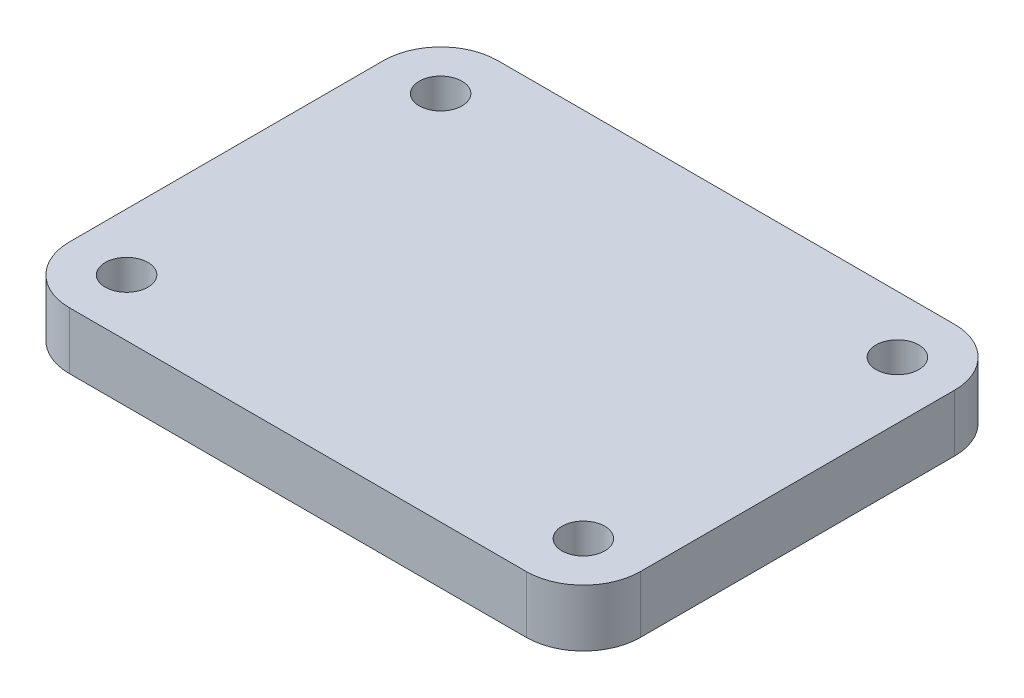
ISO-10303-21;
HEADER;
FILE_DESCRIPTION(('STEP AP214'),'2;1');
FILE_NAME('part.step','',(''),(''),'','','');
FILE_SCHEMA(('AUTOMOTIVE_DESIGN { 1 0 10303 214 1 1 1 1 }'));
ENDSEC;
DATA;
#1=APPLICATION_CONTEXT('core data for automotive mechanical design processes');
#2=APPLICATION_PROTOCOL_DEFINITION('international standard','automotive_design',2000,#1);
#3=PRODUCT_CONTEXT('',#1,'mechanical');
#4=PRODUCT('Part','Part','',(#3));
#5=PRODUCT_RELATED_PRODUCT_CATEGORY('part','',(#4));
#6=PRODUCT_DEFINITION_FORMATION('','',#4);
#7=PRODUCT_DEFINITION_CONTEXT('part definition',#1,'design');
#8=PRODUCT_DEFINITION('design','',#6,#7);
#9=PRODUCT_DEFINITION_SHAPE('','',#8);
#10=(LENGTH_UNIT() NAMED_UNIT(*) SI_UNIT(.MILLI.,.METRE.));
#11=(NAMED_UNIT(*) PLANE_ANGLE_UNIT() SI_UNIT($,.RADIAN.));
#12=(NAMED_UNIT(*) SI_UNIT($,.STERADIAN.) SOLID_ANGLE_UNIT());
#13=UNCERTAINTY_MEASURE_WITH_UNIT(LENGTH_MEASURE(1.E-05),#10,'distance_accuracy_value','');
#14=(GEOMETRIC_REPRESENTATION_CONTEXT(3) GLOBAL_UNCERTAINTY_ASSIGNED_CONTEXT((#13)) GLOBAL_UNIT_ASSIGNED_CONTEXT((#10,
#11,#12)) REPRESENTATION_CONTEXT('',''));
#15=CARTESIAN_POINT('',(0.,0.,0.));
#16=DIRECTION('',(0.,0.,1.));
#17=DIRECTION('',(1.,0.,0.));
#18=AXIS2_PLACEMENT_3D('',#15,#16,#17);
#19=CARTESIAN_POINT('',(-100.,20.,-75.));
#20=DIRECTION('',(0.,-1.,0.));
#21=DIRECTION('',(0.,0.,-1.));
#22=AXIS2_PLACEMENT_3D('',#19,#20,#21);
#23=PLANE('',#22);
#24=CARTESIAN_POINT('',(80.,20.,55.));
#25=DIRECTION('',(0.,1.,0.));
#26=DIRECTION('',(0.,0.,1.));
#27=AXIS2_PLACEMENT_3D('',#24,#25,#26);
#28=CIRCLE('',#27,7.50000000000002);
#29=CARTESIAN_POINT('',(80.,20.,62.5));
#30=VERTEX_POINT('',#29);
#31=EDGE_CURVE('E190',#30,#30,#28,.T.);
#32=ORIENTED_EDGE('',*,*,#31,.F.);
#33=EDGE_LOOP('',(#32));
#34=FACE_BOUND('',#33,.T.);
#35=CARTESIAN_POINT('',(-80.,20.,-55.));
#36=DIRECTION('',(0.,1.,0.));
#37=DIRECTION('',(0.,0.,1.));
#38=AXIS2_PLACEMENT_3D('',#35,#36,#37);
#39=CIRCLE('',#38,7.50000000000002);
#40=CARTESIAN_POINT('',(-80.,20.,-47.5));
#41=VERTEX_POINT('',#40);
#42=EDGE_CURVE('E184',#41,#41,#39,.T.);
#43=ORIENTED_EDGE('',*,*,#42,.F.);
#44=EDGE_LOOP('',(#43));
#45=FACE_BOUND('',#44,.T.);
#46=CARTESIAN_POINT('',(-80.,20.,55.));
#47=DIRECTION('',(0.,1.,0.));
#48=DIRECTION('',(0.,0.,1.));
#49=AXIS2_PLACEMENT_3D('',#46,#47,#48);
#50=CIRCLE('',#49,7.50000000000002);
#51=CARTESIAN_POINT('',(-80.,20.,62.5));
#52=VERTEX_POINT('',#51);
#53=EDGE_CURVE('E132',#52,#52,#50,.T.);
#54=ORIENTED_EDGE('',*,*,#53,.F.);
#55=EDGE_LOOP('',(#54));
#56=FACE_BOUND('',#55,.T.);
#57=DIRECTION('',(-1.,0.,0.));
#58=VECTOR('',#57,1.);
#59=CARTESIAN_POINT('',(-100.,20.,-75.));
#60=LINE('',#59,#58);
#61=CARTESIAN_POINT('',(80.,20.,-75.));
#62=VERTEX_POINT('',#61);
#63=CARTESIAN_POINT('',(-80.,20.,-75.));
#64=VERTEX_POINT('',#63);
#65=EDGE_CURVE('E135',#62,#64,#60,.T.);
#66=ORIENTED_EDGE('',*,*,#65,.T.);
#67=CARTESIAN_POINT('',(-80.,20.,-55.));
#68=DIRECTION('',(0.,-1.,0.));
#69=DIRECTION('',(0.,0.,-1.));
#70=AXIS2_PLACEMENT_3D('',#67,#68,#69);
#71=CIRCLE('',#70,20.);
#72=CARTESIAN_POINT('',(-100.,20.,-55.));
#73=VERTEX_POINT('',#72);
#74=EDGE_CURVE('E154',#64,#73,#71,.F.);
#75=ORIENTED_EDGE('',*,*,#74,.T.);
#76=DIRECTION('',(0.,0.,1.));
#77=VECTOR('',#76,1.);
#78=CARTESIAN_POINT('',(-100.,20.,75.));
#79=LINE('',#78,#77);
#80=CARTESIAN_POINT('',(-100.,20.,55.));
#81=VERTEX_POINT('',#80);
#82=EDGE_CURVE('E118',#73,#81,#79,.T.);
#83=ORIENTED_EDGE('',*,*,#82,.T.);
#84=CARTESIAN_POINT('',(-80.,20.,55.));
#85=DIRECTION('',(0.,-1.,0.));
#86=DIRECTION('',(0.,0.,-1.));
#87=AXIS2_PLACEMENT_3D('',#84,#85,#86);
#88=CIRCLE('',#87,20.);
#89=CARTESIAN_POINT('',(-80.,20.,75.));
#90=VERTEX_POINT('',#89);
#91=EDGE_CURVE('E149',#81,#90,#88,.F.);
#92=ORIENTED_EDGE('',*,*,#91,.T.);
#93=DIRECTION('',(1.,0.,0.));
#94=VECTOR('',#93,1.);
#95=CARTESIAN_POINT('',(-100.,20.,75.));
#96=LINE('',#95,#94);
#97=CARTESIAN_POINT('',(80.,20.,75.));
#98=VERTEX_POINT('',#97);
#99=EDGE_CURVE('E165',#90,#98,#96,.T.);
#100=ORIENTED_EDGE('',*,*,#99,.T.);
#101=CARTESIAN_POINT('',(80.,20.,55.));
#102=DIRECTION('',(0.,-1.,0.));
#103=DIRECTION('',(0.,0.,-1.));
#104=AXIS2_PLACEMENT_3D('',#101,#102,#103);
#105=CIRCLE('',#104,20.);
#106=CARTESIAN_POINT('',(100.,20.,55.));
#107=VERTEX_POINT('',#106);
#108=EDGE_CURVE('E54',#98,#107,#105,.F.);
#109=ORIENTED_EDGE('',*,*,#108,.T.);
#110=DIRECTION('',(0.,0.,-1.));
#111=VECTOR('',#110,1.);
#112=CARTESIAN_POINT('',(100.,20.,75.));
#113=LINE('',#112,#111);
#114=CARTESIAN_POINT('',(100.,20.,-55.));
#115=VERTEX_POINT('',#114);
#116=EDGE_CURVE('E173',#107,#115,#113,.T.);
#117=ORIENTED_EDGE('',*,*,#116,.T.);
#118=CARTESIAN_POINT('',(80.,20.,-55.));
#119=DIRECTION('',(0.,-1.,0.));
#120=DIRECTION('',(0.,0.,-1.));
#121=AXIS2_PLACEMENT_3D('',#118,#119,#120);
#122=CIRCLE('',#121,20.);
#123=EDGE_CURVE('E152',#115,#62,#122,.F.);
#124=ORIENTED_EDGE('',*,*,#123,.T.);
#125=EDGE_LOOP('',(#66,#75,#83,#92,#100,#109,#117,#124));
#126=FACE_BOUND('',#125,.T.);
#127=CARTESIAN_POINT('',(80.,20.,-55.));
#128=DIRECTION('',(0.,1.,0.));
#129=DIRECTION('',(0.,0.,1.));
#130=AXIS2_PLACEMENT_3D('',#127,#128,#129);
#131=CIRCLE('',#130,7.50000000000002);
#132=CARTESIAN_POINT('',(80.,20.,-47.5));
#133=VERTEX_POINT('',#132);
#134=EDGE_CURVE('E196',#133,#133,#131,.T.);
#135=ORIENTED_EDGE('',*,*,#134,.F.);
#136=EDGE_LOOP('',(#135));
#137=FACE_BOUND('',#136,.T.);
#138=ADVANCED_FACE('F32',(#34,#45,#56,#126,#137),#23,.F.);
#139=CARTESIAN_POINT('',(-100.,0.,-75.));
#140=DIRECTION('',(0.,-1.,0.));
#141=DIRECTION('',(0.,0.,-1.));
#142=AXIS2_PLACEMENT_3D('',#139,#140,#141);
#143=PLANE('',#142);
#144=CARTESIAN_POINT('',(80.,0.,-55.));
#145=DIRECTION('',(0.,1.,0.));
#146=DIRECTION('',(0.,0.,1.));
#147=AXIS2_PLACEMENT_3D('',#144,#145,#146);
#148=CIRCLE('',#147,7.50000000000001);
#149=CARTESIAN_POINT('',(80.,0.,-47.5));
#150=VERTEX_POINT('',#149);
#151=EDGE_CURVE('E193',#150,#150,#148,.T.);
#152=ORIENTED_EDGE('',*,*,#151,.T.);
#153=EDGE_LOOP('',(#152));
#154=FACE_BOUND('',#153,.T.);
#155=CARTESIAN_POINT('',(-80.,0.,-55.));
#156=DIRECTION('',(0.,1.,0.));
#157=DIRECTION('',(0.,0.,1.));
#158=AXIS2_PLACEMENT_3D('',#155,#156,#157);
#159=CIRCLE('',#158,7.50000000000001);
#160=CARTESIAN_POINT('',(-80.,0.,-47.5));
#161=VERTEX_POINT('',#160);
#162=EDGE_CURVE('E181',#161,#161,#159,.T.);
#163=ORIENTED_EDGE('',*,*,#162,.T.);
#164=EDGE_LOOP('',(#163));
#165=FACE_BOUND('',#164,.T.);
#166=CARTESIAN_POINT('',(-80.,0.,55.));
#167=DIRECTION('',(0.,1.,0.));
#168=DIRECTION('',(0.,0.,1.));
#169=AXIS2_PLACEMENT_3D('',#166,#167,#168);
#170=CIRCLE('',#169,7.50000000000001);
#171=CARTESIAN_POINT('',(-80.,0.,62.5));
#172=VERTEX_POINT('',#171);
#173=EDGE_CURVE('E126',#172,#172,#170,.T.);
#174=ORIENTED_EDGE('',*,*,#173,.T.);
#175=EDGE_LOOP('',(#174));
#176=FACE_BOUND('',#175,.T.);
#177=DIRECTION('',(0.,0.,1.));
#178=VECTOR('',#177,1.);
#179=CARTESIAN_POINT('',(-100.,0.,75.));
#180=LINE('',#179,#178);
#181=CARTESIAN_POINT('',(-100.,0.,-55.));
#182=VERTEX_POINT('',#181);
#183=CARTESIAN_POINT('',(-100.,0.,55.));
#184=VERTEX_POINT('',#183);
#185=EDGE_CURVE('E115',#182,#184,#180,.T.);
#186=ORIENTED_EDGE('',*,*,#185,.F.);
#187=CARTESIAN_POINT('',(-80.,0.,-55.));
#188=DIRECTION('',(0.,-1.,0.));
#189=DIRECTION('',(0.,0.,-1.));
#190=AXIS2_PLACEMENT_3D('',#187,#188,#189);
#191=CIRCLE('',#190,20.);
#192=CARTESIAN_POINT('',(-80.,0.,-75.));
#193=VERTEX_POINT('',#192);
#194=EDGE_CURVE('E98',#182,#193,#191,.T.);
#195=ORIENTED_EDGE('',*,*,#194,.T.);
#196=DIRECTION('',(-1.,0.,0.));
#197=VECTOR('',#196,1.);
#198=CARTESIAN_POINT('',(-100.,0.,-75.));
#199=LINE('',#198,#197);
#200=CARTESIAN_POINT('',(80.,0.,-75.));
#201=VERTEX_POINT('',#200);
#202=EDGE_CURVE('E139',#201,#193,#199,.T.);
#203=ORIENTED_EDGE('',*,*,#202,.F.);
#204=CARTESIAN_POINT('',(80.,0.,-55.));
#205=DIRECTION('',(0.,-1.,0.));
#206=DIRECTION('',(0.,0.,-1.));
#207=AXIS2_PLACEMENT_3D('',#204,#205,#206);
#208=CIRCLE('',#207,20.);
#209=CARTESIAN_POINT('',(100.,0.,-55.));
#210=VERTEX_POINT('',#209);
#211=EDGE_CURVE('E109',#201,#210,#208,.T.);
#212=ORIENTED_EDGE('',*,*,#211,.T.);
#213=DIRECTION('',(0.,0.,-1.));
#214=VECTOR('',#213,1.);
#215=CARTESIAN_POINT('',(100.,0.,75.));
#216=LINE('',#215,#214);
#217=CARTESIAN_POINT('',(100.,0.,55.));
#218=VERTEX_POINT('',#217);
#219=EDGE_CURVE('E129',#218,#210,#216,.T.);
#220=ORIENTED_EDGE('',*,*,#219,.F.);
#221=CARTESIAN_POINT('',(80.,0.,55.));
#222=DIRECTION('',(0.,-1.,0.));
#223=DIRECTION('',(0.,0.,-1.));
#224=AXIS2_PLACEMENT_3D('',#221,#222,#223);
#225=CIRCLE('',#224,20.);
#226=CARTESIAN_POINT('',(80.,0.,75.));
#227=VERTEX_POINT('',#226);
#228=EDGE_CURVE('E143',#218,#227,#225,.T.);
#229=ORIENTED_EDGE('',*,*,#228,.T.);
#230=DIRECTION('',(1.,0.,0.));
#231=VECTOR('',#230,1.);
#232=CARTESIAN_POINT('',(-100.,0.,75.));
#233=LINE('',#232,#231);
#234=CARTESIAN_POINT('',(-80.,0.,75.));
#235=VERTEX_POINT('',#234);
#236=EDGE_CURVE('E125',#235,#227,#233,.T.);
#237=ORIENTED_EDGE('',*,*,#236,.F.);
#238=CARTESIAN_POINT('',(-80.,0.,55.));
#239=DIRECTION('',(0.,-1.,0.));
#240=DIRECTION('',(0.,0.,-1.));
#241=AXIS2_PLACEMENT_3D('',#238,#239,#240);
#242=CIRCLE('',#241,20.);
#243=EDGE_CURVE('E119',#235,#184,#242,.T.);
#244=ORIENTED_EDGE('',*,*,#243,.T.);
#245=EDGE_LOOP('',(#186,#195,#203,#212,#220,#229,#237,#244));
#246=FACE_BOUND('',#245,.T.);
#247=CARTESIAN_POINT('',(80.,0.,55.));
#248=DIRECTION('',(0.,1.,0.));
#249=DIRECTION('',(0.,0.,1.));
#250=AXIS2_PLACEMENT_3D('',#247,#248,#249);
#251=CIRCLE('',#250,7.50000000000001);
#252=CARTESIAN_POINT('',(80.,0.,62.5));
#253=VERTEX_POINT('',#252);
#254=EDGE_CURVE('E187',#253,#253,#251,.T.);
#255=ORIENTED_EDGE('',*,*,#254,.T.);
#256=EDGE_LOOP('',(#255));
#257=FACE_BOUND('',#256,.T.);
#258=ADVANCED_FACE('F122',(#154,#165,#176,#246,#257),#143,.T.);
#259=CARTESIAN_POINT('',(-100.,20.,75.));
#260=DIRECTION('',(1.,0.,0.));
#261=DIRECTION('',(0.,0.,-1.));
#262=AXIS2_PLACEMENT_3D('',#259,#260,#261);
#263=PLANE('',#262);
#264=ORIENTED_EDGE('',*,*,#82,.F.);
#265=DIRECTION('',(0.,-1.,0.));
#266=VECTOR('',#265,1.);
#267=CARTESIAN_POINT('',(-100.,20.,-55.));
#268=LINE('',#267,#266);
#269=EDGE_CURVE('E102',#73,#182,#268,.T.);
#270=ORIENTED_EDGE('',*,*,#269,.T.);
#271=ORIENTED_EDGE('',*,*,#185,.T.);
#272=DIRECTION('',(0.,-1.,0.));
#273=VECTOR('',#272,1.);
#274=CARTESIAN_POINT('',(-100.,20.,55.));
#275=LINE('',#274,#273);
#276=EDGE_CURVE('E120',#184,#81,#275,.F.);
#277=ORIENTED_EDGE('',*,*,#276,.T.);
#278=EDGE_LOOP('',(#264,#270,#271,#277));
#279=FACE_BOUND('',#278,.T.);
#280=ADVANCED_FACE('F114',(#279),#263,.F.);
#281=CARTESIAN_POINT('',(-100.,20.,75.));
#282=DIRECTION('',(0.,0.,-1.));
#283=DIRECTION('',(-1.,0.,0.));
#284=AXIS2_PLACEMENT_3D('',#281,#282,#283);
#285=PLANE('',#284);
#286=ORIENTED_EDGE('',*,*,#236,.T.);
#287=DIRECTION('',(0.,-1.,0.));
#288=VECTOR('',#287,1.);
#289=CARTESIAN_POINT('',(80.,20.,75.));
#290=LINE('',#289,#288);
#291=EDGE_CURVE('E11',#227,#98,#290,.F.);
#292=ORIENTED_EDGE('',*,*,#291,.T.);
#293=ORIENTED_EDGE('',*,*,#99,.F.);
#294=DIRECTION('',(0.,-1.,0.));
#295=VECTOR('',#294,1.);
#296=CARTESIAN_POINT('',(-80.,20.,75.));
#297=LINE('',#296,#295);
#298=EDGE_CURVE('E40',#90,#235,#297,.T.);
#299=ORIENTED_EDGE('',*,*,#298,.T.);
#300=EDGE_LOOP('',(#286,#292,#293,#299));
#301=FACE_BOUND('',#300,.T.);
#302=ADVANCED_FACE('F163',(#301),#285,.F.);
#303=CARTESIAN_POINT('',(100.,20.,75.));
#304=DIRECTION('',(-1.,0.,0.));
#305=DIRECTION('',(0.,0.,1.));
#306=AXIS2_PLACEMENT_3D('',#303,#304,#305);
#307=PLANE('',#306);
#308=ORIENTED_EDGE('',*,*,#219,.T.);
#309=DIRECTION('',(0.,-1.,0.));
#310=VECTOR('',#309,1.);
#311=CARTESIAN_POINT('',(100.,20.,-55.));
#312=LINE('',#311,#310);
#313=EDGE_CURVE('E47',#210,#115,#312,.F.);
#314=ORIENTED_EDGE('',*,*,#313,.T.);
#315=ORIENTED_EDGE('',*,*,#116,.F.);
#316=DIRECTION('',(0.,-1.,0.));
#317=VECTOR('',#316,1.);
#318=CARTESIAN_POINT('',(100.,20.,55.));
#319=LINE('',#318,#317);
#320=EDGE_CURVE('E156',#107,#218,#319,.T.);
#321=ORIENTED_EDGE('',*,*,#320,.T.);
#322=EDGE_LOOP('',(#308,#314,#315,#321));
#323=FACE_BOUND('',#322,.T.);
#324=ADVANCED_FACE('F172',(#323),#307,.F.);
#325=CARTESIAN_POINT('',(-100.,20.,-75.));
#326=DIRECTION('',(0.,0.,1.));
#327=DIRECTION('',(1.,0.,0.));
#328=AXIS2_PLACEMENT_3D('',#325,#326,#327);
#329=PLANE('',#328);
#330=ORIENTED_EDGE('',*,*,#202,.T.);
#331=DIRECTION('',(0.,-1.,0.));
#332=VECTOR('',#331,1.);
#333=CARTESIAN_POINT('',(-80.,20.,-75.));
#334=LINE('',#333,#332);
#335=EDGE_CURVE('E103',#193,#64,#334,.F.);
#336=ORIENTED_EDGE('',*,*,#335,.T.);
#337=ORIENTED_EDGE('',*,*,#65,.F.);
#338=DIRECTION('',(0.,-1.,0.));
#339=VECTOR('',#338,1.);
#340=CARTESIAN_POINT('',(80.,20.,-75.));
#341=LINE('',#340,#339);
#342=EDGE_CURVE('E108',#62,#201,#341,.T.);
#343=ORIENTED_EDGE('',*,*,#342,.T.);
#344=EDGE_LOOP('',(#330,#336,#337,#343));
#345=FACE_BOUND('',#344,.T.);
#346=ADVANCED_FACE('F216',(#345),#329,.F.);
#347=CARTESIAN_POINT('',(-80.,20.,-55.));
#348=DIRECTION('',(0.,-1.,0.));
#349=DIRECTION('',(0.,0.,-1.));
#350=AXIS2_PLACEMENT_3D('',#347,#348,#349);
#351=CYLINDRICAL_SURFACE('',#350,20.);
#352=ORIENTED_EDGE('',*,*,#74,.F.);
#353=ORIENTED_EDGE('',*,*,#335,.F.);
#354=ORIENTED_EDGE('',*,*,#194,.F.);
#355=ORIENTED_EDGE('',*,*,#269,.F.);
#356=EDGE_LOOP('',(#352,#353,#354,#355));
#357=FACE_BOUND('',#356,.T.);
#358=ADVANCED_FACE('F101',(#357),#351,.T.);
#359=CARTESIAN_POINT('',(80.,20.,-55.));
#360=DIRECTION('',(0.,-1.,0.));
#361=DIRECTION('',(0.,0.,-1.));
#362=AXIS2_PLACEMENT_3D('',#359,#360,#361);
#363=CYLINDRICAL_SURFACE('',#362,20.);
#364=ORIENTED_EDGE('',*,*,#123,.F.);
#365=ORIENTED_EDGE('',*,*,#313,.F.);
#366=ORIENTED_EDGE('',*,*,#211,.F.);
#367=ORIENTED_EDGE('',*,*,#342,.F.);
#368=EDGE_LOOP('',(#364,#365,#366,#367));
#369=FACE_BOUND('',#368,.T.);
#370=ADVANCED_FACE('F228',(#369),#363,.T.);
#371=CARTESIAN_POINT('',(80.,20.,55.));
#372=DIRECTION('',(0.,-1.,0.));
#373=DIRECTION('',(0.,0.,-1.));
#374=AXIS2_PLACEMENT_3D('',#371,#372,#373);
#375=CYLINDRICAL_SURFACE('',#374,20.);
#376=ORIENTED_EDGE('',*,*,#108,.F.);
#377=ORIENTED_EDGE('',*,*,#291,.F.);
#378=ORIENTED_EDGE('',*,*,#228,.F.);
#379=ORIENTED_EDGE('',*,*,#320,.F.);
#380=EDGE_LOOP('',(#376,#377,#378,#379));
#381=FACE_BOUND('',#380,.T.);
#382=ADVANCED_FACE('F171',(#381),#375,.T.);
#383=CARTESIAN_POINT('',(-80.,20.,55.));
#384=DIRECTION('',(0.,-1.,0.));
#385=DIRECTION('',(0.,0.,-1.));
#386=AXIS2_PLACEMENT_3D('',#383,#384,#385);
#387=CYLINDRICAL_SURFACE('',#386,20.);
#388=ORIENTED_EDGE('',*,*,#91,.F.);
#389=ORIENTED_EDGE('',*,*,#276,.F.);
#390=ORIENTED_EDGE('',*,*,#243,.F.);
#391=ORIENTED_EDGE('',*,*,#298,.F.);
#392=EDGE_LOOP('',(#388,#389,#390,#391));
#393=FACE_BOUND('',#392,.T.);
#394=ADVANCED_FACE('F34',(#393),#387,.T.);
#395=CARTESIAN_POINT('',(-80.,20.,55.));
#396=DIRECTION('',(0.,1.,0.));
#397=DIRECTION('',(0.,0.,1.));
#398=AXIS2_PLACEMENT_3D('',#395,#396,#397);
#399=CYLINDRICAL_SURFACE('',#398,7.50000000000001);
#400=ORIENTED_EDGE('',*,*,#173,.F.);
#401=EDGE_LOOP('',(#400));
#402=FACE_BOUND('',#401,.T.);
#403=ORIENTED_EDGE('',*,*,#53,.T.);
#404=EDGE_LOOP('',(#403));
#405=FACE_BOUND('',#404,.T.);
#406=ADVANCED_FACE('F213',(#402,#405),#399,.F.);
#407=CARTESIAN_POINT('',(-80.,20.,-55.));
#408=DIRECTION('',(0.,1.,0.));
#409=DIRECTION('',(0.,0.,1.));
#410=AXIS2_PLACEMENT_3D('',#407,#408,#409);
#411=CYLINDRICAL_SURFACE('',#410,7.50000000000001);
#412=ORIENTED_EDGE('',*,*,#162,.F.);
#413=EDGE_LOOP('',(#412));
#414=FACE_BOUND('',#413,.T.);
#415=ORIENTED_EDGE('',*,*,#42,.T.);
#416=EDGE_LOOP('',(#415));
#417=FACE_BOUND('',#416,.T.);
#418=ADVANCED_FACE('F238',(#414,#417),#411,.F.);
#419=CARTESIAN_POINT('',(80.,20.,55.));
#420=DIRECTION('',(0.,1.,0.));
#421=DIRECTION('',(0.,0.,1.));
#422=AXIS2_PLACEMENT_3D('',#419,#420,#421);
#423=CYLINDRICAL_SURFACE('',#422,7.50000000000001);
#424=ORIENTED_EDGE('',*,*,#254,.F.);
#425=EDGE_LOOP('',(#424));
#426=FACE_BOUND('',#425,.T.);
#427=ORIENTED_EDGE('',*,*,#31,.T.);
#428=EDGE_LOOP('',(#427));
#429=FACE_BOUND('',#428,.T.);
#430=ADVANCED_FACE('F245',(#426,#429),#423,.F.);
#431=CARTESIAN_POINT('',(80.,20.,-55.));
#432=DIRECTION('',(0.,1.,0.));
#433=DIRECTION('',(0.,0.,1.));
#434=AXIS2_PLACEMENT_3D('',#431,#432,#433);
#435=CYLINDRICAL_SURFACE('',#434,7.50000000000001);
#436=ORIENTED_EDGE('',*,*,#151,.F.);
#437=EDGE_LOOP('',(#436));
#438=FACE_BOUND('',#437,.T.);
#439=ORIENTED_EDGE('',*,*,#134,.T.);
#440=EDGE_LOOP('',(#439));
#441=FACE_BOUND('',#440,.T.);
#442=ADVANCED_FACE('F200',(#438,#441),#435,.F.);
#443=CLOSED_SHELL('',(#138,#258,#280,#302,#324,#346,#358,#370,#382,#394,#406,#418,#430,#442));
#444=MANIFOLD_SOLID_BREP('B2',#443);
#445=ADVANCED_BREP_SHAPE_REPRESENTATION('',(#18,#444),#14);
#446=SHAPE_DEFINITION_REPRESENTATION(#9,#445);
ENDSEC;
END-ISO-10303-21;
